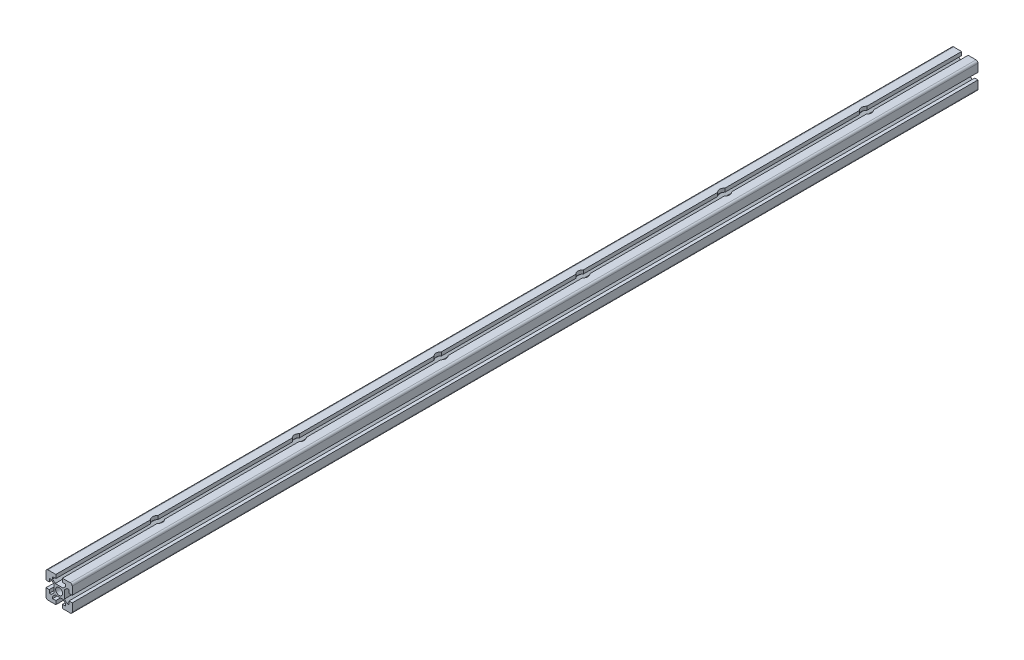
from build123d import *

# Parameters (mm, degrees)
SKETCH_1_R                   = 5.25
EXTRUDE_1_DEPTH              = 1380
HOLE_WIZARD_M8_1_D           = 9
HOLE_WIZARD_M8_1_CBORE_D     = 15
HOLE_WIZARD_M8_1_CBORE_DEPTH = 8
PATTERN_LINEAR_1_COUNT       = 6
PATTERN_LINEAR_1_PITCH       = 216


with BuildPart() as part:
    # Sketch 1 → Extrude 1 (new body)
    with BuildSketch(Plane.XY):
        with BuildLine():
            Line((10, -5.5), (15, -5.5))
            Line((15, -5.5), (15, 0))
            Line((15, 0), (3, 0))
            ThreePointArc((3, 0), (0.878679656, -0.878679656), (0, -3))
            Line((0, -3), (0, -15))
            Line((0, -15), (5, -15))
            Line((5, -15), (5, -10))
            Line((5, -10), (8, -10))
            Line((8, -10), (12, -14))
            Line((12, -14), (12, -26))
            Line((12, -26), (8, -30))
            Line((8, -30), (5, -30))
            Line((5, -30), (5, -25))
            Line((5, -25), (0, -25))
            Line((0, -25), (0, -37))
            ThreePointArc((0, -37), (0.878679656, -39.121320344), (3, -40))
            Line((3, -40), (15, -40))
            Line((15, -40), (15, -34.5))
            Line((15, -34.5), (10, -34.5))
            Line((10, -34.5), (10, -31.5))
            Line((10, -31.5), (14, -27.5))
            Line((14, -27.5), (26, -27.5))
            Line((26, -27.5), (30, -31.5))
            Line((30, -31.5), (30, -34.5))
            Line((30, -34.5), (25, -34.5))
            Line((25, -34.5), (25, -40))
            Line((25, -40), (37, -40))
            ThreePointArc((37, -40), (39.121320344, -39.121320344), (40, -37))
            Line((40, -37), (40, -25))
            Line((40, -25), (35, -25))
            Line((35, -25), (35, -30))
            Line((35, -30), (32, -30))
            Line((32, -30), (28, -26))
            Line((28, -26), (28, -14))
            Line((28, -14), (32, -10))
            Line((32, -10), (35, -10))
            Line((35, -10), (35, -15))
            Line((35, -15), (40, -15))
            Line((40, -15), (40, -3))
            ThreePointArc((40, -3), (39.121320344, -0.878679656), (37, 0))
            Line((37, 0), (25, 0))
            Line((25, 0), (25, -5.5))
            Line((25, -5.5), (30, -5.5))
            Line((30, -5.5), (30, -8.5))
            Line((30, -8.5), (26, -12.5))
            Line((26, -12.5), (14, -12.5))
            Line((14, -12.5), (10, -8.5))
            Line((10, -8.5), (10, -5.5))
        make_face()
        with Locations((20, -20)):
            Circle(SKETCH_1_R, mode=Mode.SUBTRACT)
    extrude(amount=EXTRUDE_1_DEPTH)

    # Hole Wizard M8 _1 (through all)
    with Locations(Plane(origin=(0, 0, 0), x_dir=(-1, 0, 0), z_dir=(0, 1, 0))):
        with Locations((-20, 150)):
            hole_wizard_m8_1 = CounterBoreHole(HOLE_WIZARD_M8_1_D / 2, HOLE_WIZARD_M8_1_CBORE_D / 2, HOLE_WIZARD_M8_1_CBORE_DEPTH)

    # Pattern Linear 1: Hole Wizard M8 _1 ×6
    with Locations(*[(0, 0, i * PATTERN_LINEAR_1_PITCH) for i in range(1, PATTERN_LINEAR_1_COUNT)]):
        add(hole_wizard_m8_1, mode=Mode.SUBTRACT)


solid = part.part
